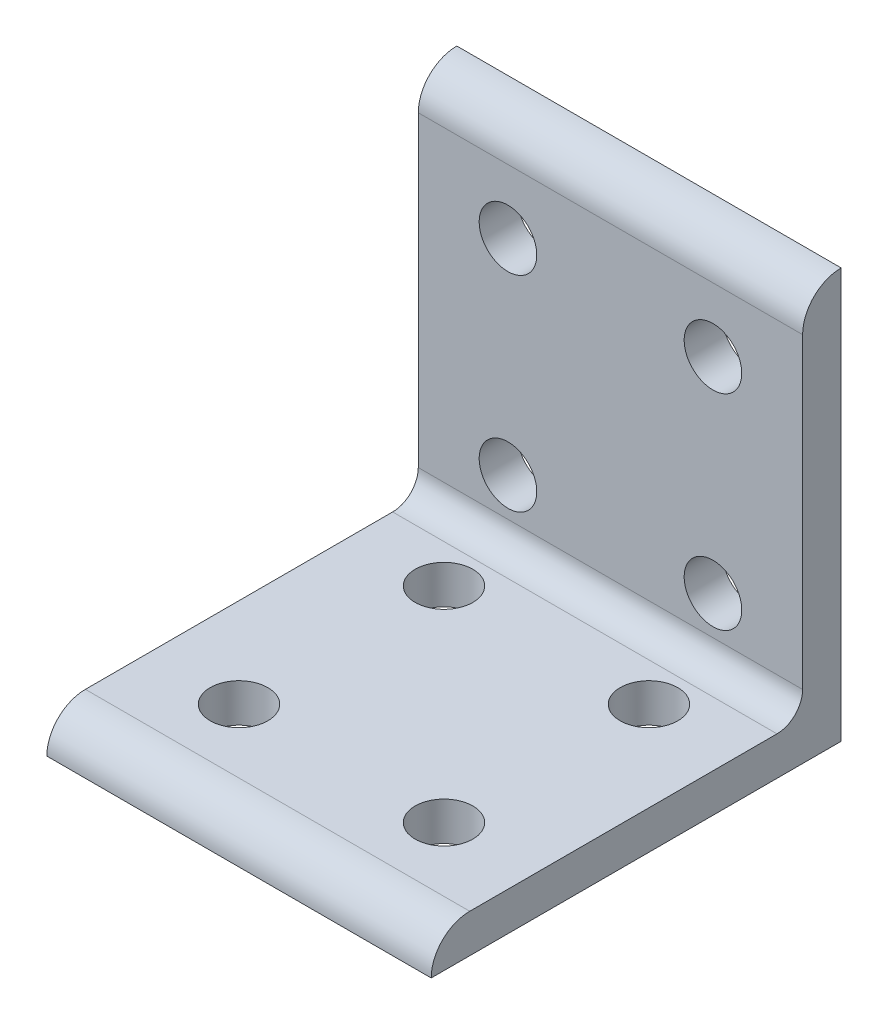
from build123d import *

# Parameters (mm, degrees)
BOSS_EXTRUDE1_DEPTH      = 23.8125
BOSS_EXTRUDE1_DEPTH_BACK = 23.8125
SKETCH2_R                = 3.5687
CUT_EXTRUDE1_DEPTH       = 5.25272
SKETCH3_R                = 3.5687
CUT_EXTRUDE2_DEPTH       = 5.25272
SKETCH4_R                = 3.5687
CUT_EXTRUDE3_DEPTH       = 5.25272
SKETCH5_R                = 3.5687
CUT_EXTRUDE4_DEPTH       = 5.25272
SKETCH6_R                = 3.5687
CUT_EXTRUDE5_DEPTH       = 5.25272
SKETCH7_R                = 3.5687
CUT_EXTRUDE6_DEPTH       = 5.25272
SKETCH8_R                = 3.5687
CUT_EXTRUDE7_DEPTH       = 5.25272
SKETCH9_R                = 3.5687
CUT_EXTRUDE8_DEPTH       = 5.25272


with BuildPart() as part:
    # Sketch1 → Boss-Extrude1 (new, two sides: drawn at the far end of the back side and taken through both)
    with BuildSketch(Plane(origin=(0, 0, 0), x_dir=(0, 0, -1), z_dir=(1, 0, 0)).offset(-BOSS_EXTRUDE1_DEPTH_BACK)):
        with BuildLine():
            Line((-50.8, 0), (0, 0))
            Line((0, 0), (0, 50.8))
            ThreePointArc((0, 50.8), (-3.376576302, 49.401376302), (-4.7752, 46.0248))
            Line((-4.7752, 46.0248), (-4.7752, 7.9502))
            ThreePointArc((-4.7752, 7.9502), (-5.70513597, 5.70513597), (-7.9502, 4.7752))
            Line((-7.9502, 4.7752), (-46.0248, 4.7752))
            ThreePointArc((-46.0248, 4.7752), (-49.401376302, 3.376576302), (-50.8, 0))
        make_face()
    extrude(amount=BOSS_EXTRUDE1_DEPTH + BOSS_EXTRUDE1_DEPTH_BACK)

    # Sketch2 → Cut-Extrude1 (cut)
    with BuildSketch(Plane.XY):
        with Locations(Location((12.7, 38.1, 0), (0, 0, 180))):
            Circle(SKETCH2_R)
    extrude(amount=CUT_EXTRUDE1_DEPTH, mode=Mode.SUBTRACT)

    # Sketch3 → Cut-Extrude2 (cut)
    with BuildSketch(Plane.XY):
        with Locations(Location((-12.7, 12.7, 0), (0, 0, 180))):
            Circle(SKETCH3_R)
    extrude(amount=CUT_EXTRUDE2_DEPTH, mode=Mode.SUBTRACT)

    # Sketch4 → Cut-Extrude3 (cut)
    with BuildSketch(Plane.XY):
        with Locations(Location((-12.7, 38.1, 0), (0, 0, 180))):
            Circle(SKETCH4_R)
    extrude(amount=CUT_EXTRUDE3_DEPTH, mode=Mode.SUBTRACT)

    # Sketch5 → Cut-Extrude4 (cut)
    with BuildSketch(Plane(origin=(0, 0, 0), x_dir=(1, 0, 0), z_dir=(0, 1, 0))):
        with Locations(Location((12.7, -12.7, 0), (0, 0, 90))):
            Circle(SKETCH5_R)
    extrude(amount=CUT_EXTRUDE4_DEPTH, mode=Mode.SUBTRACT)

    # Sketch6 → Cut-Extrude5 (cut)
    with BuildSketch(Plane(origin=(0, 0, 0), x_dir=(1, 0, 0), z_dir=(0, 1, 0))):
        with Locations(Location((12.7, -38.1, 0), (0, 0, 90))):
            Circle(SKETCH6_R)
    extrude(amount=CUT_EXTRUDE5_DEPTH, mode=Mode.SUBTRACT)

    # Sketch7 → Cut-Extrude6 (cut)
    with BuildSketch(Plane(origin=(0, 0, 0), x_dir=(1, 0, 0), z_dir=(0, 1, 0))):
        with Locations(Location((-12.7, -12.7, 0), (0, 0, 90))):
            Circle(SKETCH7_R)
    extrude(amount=CUT_EXTRUDE6_DEPTH, mode=Mode.SUBTRACT)

    # Sketch8 → Cut-Extrude7 (cut)
    with BuildSketch(Plane(origin=(0, 0, 0), x_dir=(1, 0, 0), z_dir=(0, 1, 0))):
        with Locations(Location((-12.7, -38.1, 0), (0, 0, 90))):
            Circle(SKETCH8_R)
    extrude(amount=CUT_EXTRUDE7_DEPTH, mode=Mode.SUBTRACT)

    # Sketch9 → Cut-Extrude8 (cut)
    with BuildSketch(Plane.XY):
        with Locations(Location((12.7, 12.7, 0), (0, 0, 180))):
            Circle(SKETCH9_R)
    extrude(amount=CUT_EXTRUDE8_DEPTH, mode=Mode.SUBTRACT)


solid = part.part
